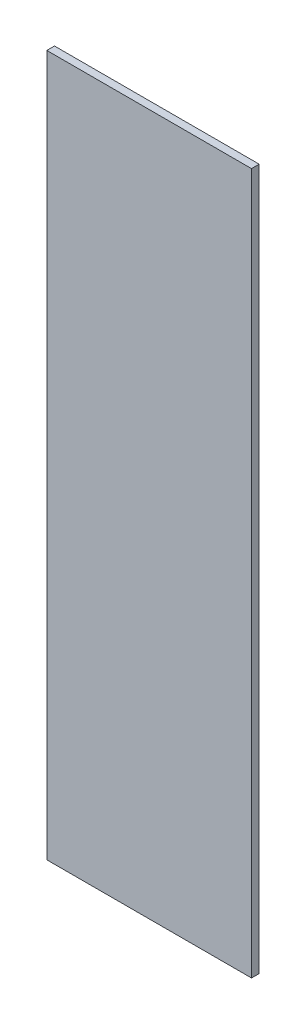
ISO-10303-21;
HEADER;
FILE_DESCRIPTION(('STEP AP214'),'2;1');
FILE_NAME('part.step','',(''),(''),'','','');
FILE_SCHEMA(('AUTOMOTIVE_DESIGN { 1 0 10303 214 1 1 1 1 }'));
ENDSEC;
DATA;
#1=APPLICATION_CONTEXT('core data for automotive mechanical design processes');
#2=APPLICATION_PROTOCOL_DEFINITION('international standard','automotive_design',2000,#1);
#3=PRODUCT_CONTEXT('',#1,'mechanical');
#4=PRODUCT('Part','Part','',(#3));
#5=PRODUCT_RELATED_PRODUCT_CATEGORY('part','',(#4));
#6=PRODUCT_DEFINITION_FORMATION('','',#4);
#7=PRODUCT_DEFINITION_CONTEXT('part definition',#1,'design');
#8=PRODUCT_DEFINITION('design','',#6,#7);
#9=PRODUCT_DEFINITION_SHAPE('','',#8);
#10=(LENGTH_UNIT() NAMED_UNIT(*) SI_UNIT(.MILLI.,.METRE.));
#11=(NAMED_UNIT(*) PLANE_ANGLE_UNIT() SI_UNIT($,.RADIAN.));
#12=(NAMED_UNIT(*) SI_UNIT($,.STERADIAN.) SOLID_ANGLE_UNIT());
#13=UNCERTAINTY_MEASURE_WITH_UNIT(LENGTH_MEASURE(1.E-05),#10,'distance_accuracy_value','');
#14=(GEOMETRIC_REPRESENTATION_CONTEXT(3) GLOBAL_UNCERTAINTY_ASSIGNED_CONTEXT((#13)) GLOBAL_UNIT_ASSIGNED_CONTEXT((#10,
#11,#12)) REPRESENTATION_CONTEXT('',''));
#15=CARTESIAN_POINT('',(0.,0.,0.));
#16=DIRECTION('',(0.,0.,1.));
#17=DIRECTION('',(1.,0.,0.));
#18=AXIS2_PLACEMENT_3D('',#15,#16,#17);
#19=CARTESIAN_POINT('',(200.,685.,15.));
#20=DIRECTION('',(-1.,0.,0.));
#21=DIRECTION('',(0.,-1.,0.));
#22=AXIS2_PLACEMENT_3D('',#19,#20,#21);
#23=PLANE('',#22);
#24=DIRECTION('',(0.,1.,0.));
#25=VECTOR('',#24,1.);
#26=CARTESIAN_POINT('',(200.,685.,0.));
#27=LINE('',#26,#25);
#28=CARTESIAN_POINT('',(200.,-685.,0.));
#29=VERTEX_POINT('',#28);
#30=CARTESIAN_POINT('',(200.,685.,0.));
#31=VERTEX_POINT('',#30);
#32=EDGE_CURVE('E111',#29,#31,#27,.T.);
#33=ORIENTED_EDGE('',*,*,#32,.T.);
#34=DIRECTION('',(0.,0.,-1.));
#35=VECTOR('',#34,1.);
#36=CARTESIAN_POINT('',(200.,685.,15.));
#37=LINE('',#36,#35);
#38=CARTESIAN_POINT('',(200.,685.,15.));
#39=VERTEX_POINT('',#38);
#40=EDGE_CURVE('E11',#39,#31,#37,.T.);
#41=ORIENTED_EDGE('',*,*,#40,.F.);
#42=DIRECTION('',(0.,1.,0.));
#43=VECTOR('',#42,1.);
#44=CARTESIAN_POINT('',(200.,685.,15.));
#45=LINE('',#44,#43);
#46=CARTESIAN_POINT('',(200.,-685.,15.));
#47=VERTEX_POINT('',#46);
#48=EDGE_CURVE('E95',#47,#39,#45,.T.);
#49=ORIENTED_EDGE('',*,*,#48,.F.);
#50=DIRECTION('',(0.,0.,-1.));
#51=VECTOR('',#50,1.);
#52=CARTESIAN_POINT('',(200.,-685.,15.));
#53=LINE('',#52,#51);
#54=EDGE_CURVE('E107',#47,#29,#53,.T.);
#55=ORIENTED_EDGE('',*,*,#54,.T.);
#56=EDGE_LOOP('',(#33,#41,#49,#55));
#57=FACE_BOUND('',#56,.T.);
#58=ADVANCED_FACE('F43',(#57),#23,.F.);
#59=CARTESIAN_POINT('',(-200.,685.,15.));
#60=DIRECTION('',(0.,-1.,0.));
#61=DIRECTION('',(0.,0.,-1.));
#62=AXIS2_PLACEMENT_3D('',#59,#60,#61);
#63=PLANE('',#62);
#64=DIRECTION('',(-1.,0.,0.));
#65=VECTOR('',#64,1.);
#66=CARTESIAN_POINT('',(-200.,685.,0.));
#67=LINE('',#66,#65);
#68=CARTESIAN_POINT('',(-200.,685.,0.));
#69=VERTEX_POINT('',#68);
#70=EDGE_CURVE('E100',#31,#69,#67,.T.);
#71=ORIENTED_EDGE('',*,*,#70,.T.);
#72=DIRECTION('',(0.,0.,-1.));
#73=VECTOR('',#72,1.);
#74=CARTESIAN_POINT('',(-200.,685.,15.));
#75=LINE('',#74,#73);
#76=CARTESIAN_POINT('',(-200.,685.,15.));
#77=VERTEX_POINT('',#76);
#78=EDGE_CURVE('E52',#77,#69,#75,.T.);
#79=ORIENTED_EDGE('',*,*,#78,.F.);
#80=DIRECTION('',(-1.,0.,0.));
#81=VECTOR('',#80,1.);
#82=CARTESIAN_POINT('',(-200.,685.,15.));
#83=LINE('',#82,#81);
#84=EDGE_CURVE('E90',#39,#77,#83,.T.);
#85=ORIENTED_EDGE('',*,*,#84,.F.);
#86=ORIENTED_EDGE('',*,*,#40,.T.);
#87=EDGE_LOOP('',(#71,#79,#85,#86));
#88=FACE_BOUND('',#87,.T.);
#89=ADVANCED_FACE('F99',(#88),#63,.F.);
#90=CARTESIAN_POINT('',(-200.,685.,15.));
#91=DIRECTION('',(1.,0.,0.));
#92=DIRECTION('',(0.,1.,0.));
#93=AXIS2_PLACEMENT_3D('',#90,#91,#92);
#94=PLANE('',#93);
#95=DIRECTION('',(0.,-1.,0.));
#96=VECTOR('',#95,1.);
#97=CARTESIAN_POINT('',(-200.,685.,0.));
#98=LINE('',#97,#96);
#99=CARTESIAN_POINT('',(-200.,-685.,0.));
#100=VERTEX_POINT('',#99);
#101=EDGE_CURVE('E77',#69,#100,#98,.T.);
#102=ORIENTED_EDGE('',*,*,#101,.T.);
#103=DIRECTION('',(0.,0.,-1.));
#104=VECTOR('',#103,1.);
#105=CARTESIAN_POINT('',(-200.,-685.,15.));
#106=LINE('',#105,#104);
#107=CARTESIAN_POINT('',(-200.,-685.,15.));
#108=VERTEX_POINT('',#107);
#109=EDGE_CURVE('E102',#108,#100,#106,.T.);
#110=ORIENTED_EDGE('',*,*,#109,.F.);
#111=DIRECTION('',(0.,-1.,0.));
#112=VECTOR('',#111,1.);
#113=CARTESIAN_POINT('',(-200.,685.,15.));
#114=LINE('',#113,#112);
#115=EDGE_CURVE('E93',#77,#108,#114,.T.);
#116=ORIENTED_EDGE('',*,*,#115,.F.);
#117=ORIENTED_EDGE('',*,*,#78,.T.);
#118=EDGE_LOOP('',(#102,#110,#116,#117));
#119=FACE_BOUND('',#118,.T.);
#120=ADVANCED_FACE('F103',(#119),#94,.F.);
#121=CARTESIAN_POINT('',(-200.,-685.,15.));
#122=DIRECTION('',(0.,1.,0.));
#123=DIRECTION('',(0.,0.,1.));
#124=AXIS2_PLACEMENT_3D('',#121,#122,#123);
#125=PLANE('',#124);
#126=DIRECTION('',(1.,0.,0.));
#127=VECTOR('',#126,1.);
#128=CARTESIAN_POINT('',(-200.,-685.,0.));
#129=LINE('',#128,#127);
#130=EDGE_CURVE('E83',#100,#29,#129,.T.);
#131=ORIENTED_EDGE('',*,*,#130,.T.);
#132=ORIENTED_EDGE('',*,*,#54,.F.);
#133=DIRECTION('',(1.,0.,0.));
#134=VECTOR('',#133,1.);
#135=CARTESIAN_POINT('',(-200.,-685.,15.));
#136=LINE('',#135,#134);
#137=EDGE_CURVE('E60',#108,#47,#136,.T.);
#138=ORIENTED_EDGE('',*,*,#137,.F.);
#139=ORIENTED_EDGE('',*,*,#109,.T.);
#140=EDGE_LOOP('',(#131,#132,#138,#139));
#141=FACE_BOUND('',#140,.T.);
#142=ADVANCED_FACE('F124',(#141),#125,.F.);
#143=CARTESIAN_POINT('',(0.,0.,15.));
#144=DIRECTION('',(0.,0.,1.));
#145=DIRECTION('',(1.,0.,0.));
#146=AXIS2_PLACEMENT_3D('',#143,#144,#145);
#147=PLANE('',#146);
#148=ORIENTED_EDGE('',*,*,#48,.T.);
#149=ORIENTED_EDGE('',*,*,#84,.T.);
#150=ORIENTED_EDGE('',*,*,#115,.T.);
#151=ORIENTED_EDGE('',*,*,#137,.T.);
#152=EDGE_LOOP('',(#148,#149,#150,#151));
#153=FACE_BOUND('',#152,.T.);
#154=ADVANCED_FACE('F91',(#153),#147,.T.);
#155=CARTESIAN_POINT('',(0.,0.,0.));
#156=DIRECTION('',(0.,0.,1.));
#157=DIRECTION('',(1.,0.,0.));
#158=AXIS2_PLACEMENT_3D('',#155,#156,#157);
#159=PLANE('',#158);
#160=ORIENTED_EDGE('',*,*,#32,.F.);
#161=ORIENTED_EDGE('',*,*,#130,.F.);
#162=ORIENTED_EDGE('',*,*,#101,.F.);
#163=ORIENTED_EDGE('',*,*,#70,.F.);
#164=EDGE_LOOP('',(#160,#161,#162,#163));
#165=FACE_BOUND('',#164,.T.);
#166=ADVANCED_FACE('F127',(#165),#159,.F.);
#167=CLOSED_SHELL('',(#58,#89,#120,#142,#154,#166));
#168=MANIFOLD_SOLID_BREP('B2',#167);
#169=ADVANCED_BREP_SHAPE_REPRESENTATION('',(#18,#168),#14);
#170=SHAPE_DEFINITION_REPRESENTATION(#9,#169);
ENDSEC;
END-ISO-10303-21;
